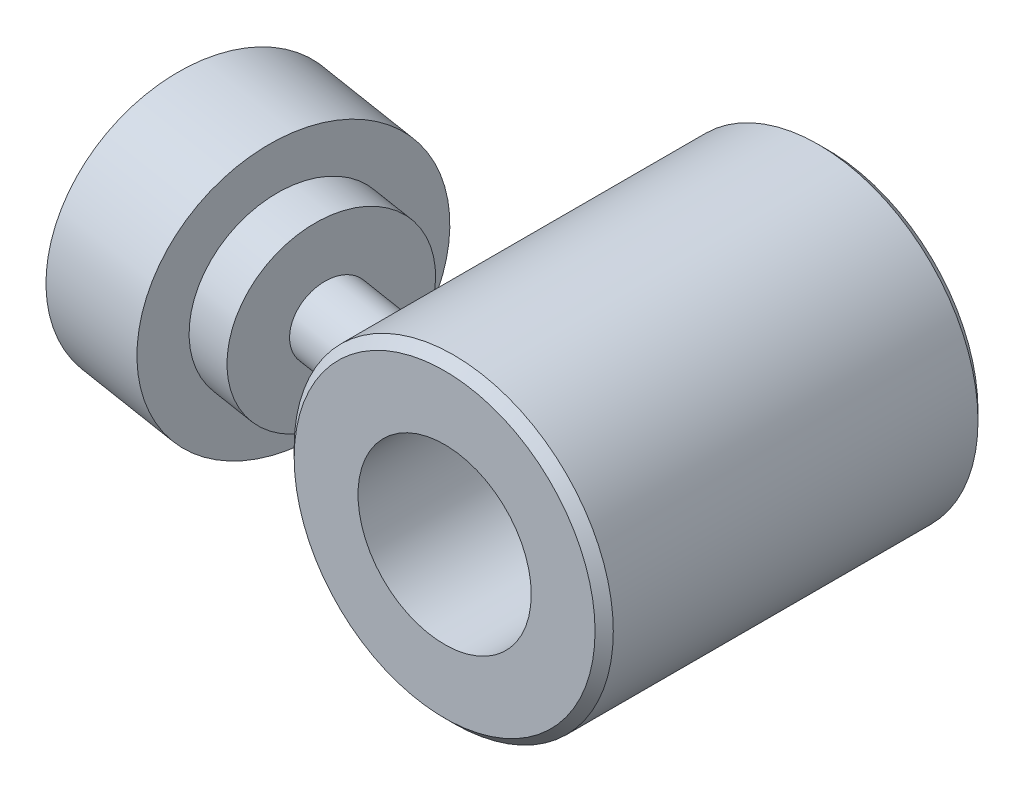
ISO-10303-21;
HEADER;
FILE_DESCRIPTION(('STEP AP214'),'2;1');
FILE_NAME('part.step','',(''),(''),'','','');
FILE_SCHEMA(('AUTOMOTIVE_DESIGN { 1 0 10303 214 1 1 1 1 }'));
ENDSEC;
DATA;
#1=APPLICATION_CONTEXT('core data for automotive mechanical design processes');
#2=APPLICATION_PROTOCOL_DEFINITION('international standard','automotive_design',2000,#1);
#3=PRODUCT_CONTEXT('',#1,'mechanical');
#4=PRODUCT('Part','Part','',(#3));
#5=PRODUCT_RELATED_PRODUCT_CATEGORY('part','',(#4));
#6=PRODUCT_DEFINITION_FORMATION('','',#4);
#7=PRODUCT_DEFINITION_CONTEXT('part definition',#1,'design');
#8=PRODUCT_DEFINITION('design','',#6,#7);
#9=PRODUCT_DEFINITION_SHAPE('','',#8);
#10=(LENGTH_UNIT() NAMED_UNIT(*) SI_UNIT(.MILLI.,.METRE.));
#11=(NAMED_UNIT(*) PLANE_ANGLE_UNIT() SI_UNIT($,.RADIAN.));
#12=(NAMED_UNIT(*) SI_UNIT($,.STERADIAN.) SOLID_ANGLE_UNIT());
#13=UNCERTAINTY_MEASURE_WITH_UNIT(LENGTH_MEASURE(1.E-05),#10,'distance_accuracy_value','');
#14=(GEOMETRIC_REPRESENTATION_CONTEXT(3) GLOBAL_UNCERTAINTY_ASSIGNED_CONTEXT((#13)) GLOBAL_UNIT_ASSIGNED_CONTEXT((#10,
#11,#12)) REPRESENTATION_CONTEXT('',''));
#15=CARTESIAN_POINT('',(0.,0.,0.));
#16=DIRECTION('',(0.,0.,1.));
#17=DIRECTION('',(1.,0.,0.));
#18=AXIS2_PLACEMENT_3D('',#15,#16,#17);
#19=CARTESIAN_POINT('',(-37.1481458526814,0.,25.3880394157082));
#20=DIRECTION('',(0.987688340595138,0.,0.156434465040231));
#21=DIRECTION('',(-0.156434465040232,0.,0.987688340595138));
#22=AXIS2_PLACEMENT_3D('',#19,#20,#21);
#23=CYLINDRICAL_SURFACE('',#22,4.);
#24=CARTESIAN_POINT('',(-17.5,0.,32.549860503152));
#25=CARTESIAN_POINT('',(-17.4999957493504,0.224614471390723,32.5498539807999));
#26=CARTESIAN_POINT('',(-17.4956327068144,0.449318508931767,32.5313396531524));
#27=CARTESIAN_POINT('',(-17.4786392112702,0.892435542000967,32.4577221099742));
#28=CARTESIAN_POINT('',(-17.466003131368,1.11084415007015,32.4025939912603));
#29=CARTESIAN_POINT('',(-17.4338463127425,1.53500330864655,32.2571782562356));
#30=CARTESIAN_POINT('',(-17.4143281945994,1.74075864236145,32.1669040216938));
#31=CARTESIAN_POINT('',(-17.3705421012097,2.13387663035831,31.9534994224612));
#32=CARTESIAN_POINT('',(-17.3462746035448,2.32124113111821,31.8303723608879));
#33=CARTESIAN_POINT('',(-17.2956371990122,2.67254969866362,31.554214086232));
#34=CARTESIAN_POINT('',(-17.2692645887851,2.83646287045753,31.4011440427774));
#35=CARTESIAN_POINT('',(-17.2174178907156,3.13586762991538,31.0692182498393));
#36=CARTESIAN_POINT('',(-17.1919437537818,3.27136077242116,30.890363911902));
#37=CARTESIAN_POINT('',(-17.1450047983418,3.50904954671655,30.5132847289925));
#38=CARTESIAN_POINT('',(-17.1235096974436,3.61150148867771,30.3152252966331));
#39=CARTESIAN_POINT('',(-17.0867315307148,3.78169775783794,29.9041969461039));
#40=CARTESIAN_POINT('',(-17.071447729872,3.84944619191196,29.6912297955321));
#41=CARTESIAN_POINT('',(-17.0489280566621,3.94798646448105,29.2592561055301));
#42=CARTESIAN_POINT('',(-17.0415966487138,3.9792173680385,29.0403543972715));
#43=CARTESIAN_POINT('',(-17.0353528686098,4.00586319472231,28.6002825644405));
#44=CARTESIAN_POINT('',(-17.0364409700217,4.0012761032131,28.3791123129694));
#45=CARTESIAN_POINT('',(-17.0468237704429,3.95680559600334,27.9380003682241));
#46=CARTESIAN_POINT('',(-17.0562129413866,3.91651584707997,27.7181022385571));
#47=CARTESIAN_POINT('',(-17.0821528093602,3.80177307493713,27.287851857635));
#48=CARTESIAN_POINT('',(-17.0987051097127,3.72731240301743,27.0775017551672));
#49=CARTESIAN_POINT('',(-17.1378795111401,3.54292035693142,26.6635686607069));
#50=CARTESIAN_POINT('',(-17.1607139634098,3.43171388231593,26.460573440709));
#51=CARTESIAN_POINT('',(-17.2095501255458,3.17774497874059,26.0757614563));
#52=CARTESIAN_POINT('',(-17.2355525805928,3.03497511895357,25.8939496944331));
#53=CARTESIAN_POINT('',(-17.2885137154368,2.71731655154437,25.5523458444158));
#54=CARTESIAN_POINT('',(-17.3154801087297,2.54171848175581,25.3932124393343));
#55=CARTESIAN_POINT('',(-17.3665728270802,2.16521302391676,25.1077562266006));
#56=CARTESIAN_POINT('',(-17.3906996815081,1.96431036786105,24.9814272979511));
#57=CARTESIAN_POINT('',(-17.4324970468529,1.54923721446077,24.7698430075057));
#58=CARTESIAN_POINT('',(-17.4503460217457,1.33567891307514,24.6834256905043));
#59=CARTESIAN_POINT('',(-17.4784212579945,0.896184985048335,24.5497264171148));
#60=CARTESIAN_POINT('',(-17.4886512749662,0.670255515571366,24.5024251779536));
#61=CARTESIAN_POINT('',(-17.4998301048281,0.227725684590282,24.4508532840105));
#62=CARTESIAN_POINT('',(-17.5013210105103,0.0114294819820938,24.4440688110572));
#63=CARTESIAN_POINT('',(-17.4963048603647,-0.419085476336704,24.4671089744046));
#64=CARTESIAN_POINT('',(-17.489799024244,-0.63330454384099,24.4969280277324));
#65=CARTESIAN_POINT('',(-17.4697946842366,-1.04801423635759,24.5906483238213));
#66=CARTESIAN_POINT('',(-17.4564779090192,-1.24871532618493,24.6536650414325));
#67=CARTESIAN_POINT('',(-17.4243532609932,-1.63704573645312,24.8108094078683));
#68=CARTESIAN_POINT('',(-17.4055445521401,-1.8246730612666,24.9049417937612));
#69=CARTESIAN_POINT('',(-17.3635294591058,-2.18924524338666,25.1252195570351));
#70=CARTESIAN_POINT('',(-17.3401852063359,-2.3655305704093,25.2524280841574));
#71=CARTESIAN_POINT('',(-17.2919524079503,-2.69560016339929,25.5330478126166));
#72=CARTESIAN_POINT('',(-17.2670633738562,-2.84937725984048,25.6864673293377));
#73=CARTESIAN_POINT('',(-17.2166804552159,-3.13990421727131,26.0255416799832));
#74=CARTESIAN_POINT('',(-17.1912429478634,-3.27503349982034,26.2125956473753));
#75=CARTESIAN_POINT('',(-17.144170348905,-3.51314694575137,26.6066225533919));
#76=CARTESIAN_POINT('',(-17.1225360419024,-3.61612447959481,26.8135995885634));
#77=CARTESIAN_POINT('',(-17.0850498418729,-3.78935161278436,27.2478052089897));
#78=CARTESIAN_POINT('',(-17.0693664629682,-3.85866112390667,27.4754252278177));
#79=CARTESIAN_POINT('',(-17.046655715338,-3.95779784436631,27.9395346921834));
#80=CARTESIAN_POINT('',(-17.0396266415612,-3.98763283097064,28.176022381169));
#81=CARTESIAN_POINT('',(-17.0353470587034,-4.00587500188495,28.6441743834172));
#82=CARTESIAN_POINT('',(-17.0378324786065,-3.9954009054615,28.875792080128));
#83=CARTESIAN_POINT('',(-17.0518556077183,-3.93512027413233,29.3335629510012));
#84=CARTESIAN_POINT('',(-17.0633912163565,-3.88532286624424,29.5597173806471));
#85=CARTESIAN_POINT('',(-17.0936083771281,-3.75008091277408,29.9911728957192));
#86=CARTESIAN_POINT('',(-17.1120042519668,-3.66605044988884,30.1969386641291));
#87=CARTESIAN_POINT('',(-17.1538823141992,-3.46479928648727,30.5909656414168));
#88=CARTESIAN_POINT('',(-17.1773642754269,-3.34758006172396,30.7792276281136));
#89=CARTESIAN_POINT('',(-17.2266034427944,-3.08413874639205,31.1318911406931));
#90=CARTESIAN_POINT('',(-17.2523445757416,-2.93811357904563,31.2964422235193));
#91=CARTESIAN_POINT('',(-17.3034160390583,-2.62061004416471,31.598945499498));
#92=CARTESIAN_POINT('',(-17.3287462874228,-2.44912666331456,31.7368924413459));
#93=CARTESIAN_POINT('',(-17.3765824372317,-2.08299901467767,31.9843622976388));
#94=CARTESIAN_POINT('',(-17.3990460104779,-1.88807553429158,32.0934801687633));
#95=CARTESIAN_POINT('',(-17.4382827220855,-1.48246254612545,32.2780292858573));
#96=CARTESIAN_POINT('',(-17.4550595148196,-1.27178326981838,32.3534821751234));
#97=CARTESIAN_POINT('',(-17.4784899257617,-0.884370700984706,32.4571671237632));
#98=CARTESIAN_POINT('',(-17.4865066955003,-0.709420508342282,32.491873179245));
#99=CARTESIAN_POINT('',(-17.4972634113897,-0.356332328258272,32.5382224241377));
#100=CARTESIAN_POINT('',(-17.5000033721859,-0.178194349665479,32.5498656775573));
#101=CARTESIAN_POINT('',(-17.5,0.,32.549860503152));
#102=B_SPLINE_CURVE_WITH_KNOTS('',3,(#24,#25,#26,#27,#28,#29,#30,#31,#32,#33,#34,#35,#36,#37,
#38,#39,#40,#41,#42,#43,#44,#45,#46,#47,#48,#49,#50,#51,#52,#53,#54,#55,#56,#57,#58,#59,#60,#61,
#62,#63,#64,#65,#66,#67,#68,#69,#70,#71,#72,#73,#74,#75,#76,#77,#78,#79,#80,#81,#82,#83,#84,#85,
#86,#87,#88,#89,#90,#91,#92,#93,#94,#95,#96,#97,#98,#99,#100,#101),.UNSPECIFIED.,.T.,.F.,(4,2,2,
2,2,2,2,2,2,2,2,2,2,2,2,2,2,2,2,2,2,2,2,2,2,2,2,2,2,2,2,2,2,2,2,2,2,2,4),(0.,0.673201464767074,
1.34686128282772,2.02026485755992,2.6936007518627,3.36781569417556,4.04199374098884,
4.71080864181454,5.37954437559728,6.0401541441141,6.70080106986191,7.36906481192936,
8.03747820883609,8.73207239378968,9.42683027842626,10.1388354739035,10.8507077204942,
11.5402958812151,12.2295438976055,12.8755434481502,13.5214444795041,14.150946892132,
14.7805451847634,15.433628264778,16.0869189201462,16.7802373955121,17.4736987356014,
18.1855455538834,18.8972521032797,19.5893506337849,20.2812885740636,20.9471508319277,
21.61298348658,22.2744129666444,22.9359728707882,23.6063851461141,24.2763657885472,
24.8104410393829,25.3445148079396),.UNSPECIFIED.);
#103=CARTESIAN_POINT('',(-17.5,0.,32.549860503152));
#104=VERTEX_POINT('',#103);
#105=EDGE_CURVE('E216',#104,#104,#102,.T.);
#106=ORIENTED_EDGE('',*,*,#105,.T.);
#107=EDGE_LOOP('',(#106));
#108=FACE_BOUND('',#107,.T.);
#109=CARTESIAN_POINT('',(-27.5181845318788,0.,26.9132754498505));
#110=DIRECTION('',(-0.987688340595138,0.,-0.156434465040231));
#111=DIRECTION('',(0.,1.,0.));
#112=AXIS2_PLACEMENT_3D('',#109,#110,#111);
#113=CIRCLE('',#112,4.);
#114=CARTESIAN_POINT('',(-27.5181845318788,4.00000000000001,26.9132754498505));
#115=VERTEX_POINT('',#114);
#116=EDGE_CURVE('E212',#115,#115,#113,.T.);
#117=ORIENTED_EDGE('',*,*,#116,.F.);
#118=EDGE_LOOP('',(#117));
#119=FACE_BOUND('',#118,.T.);
#120=ADVANCED_FACE('F15',(#108,#119),#23,.T.);
#121=CARTESIAN_POINT('',(-35.5515849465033,0.,29.6907703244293));
#122=DIRECTION('',(-0.987688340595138,0.,-0.156434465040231));
#123=DIRECTION('',(0.156434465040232,0.,-0.987688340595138));
#124=AXIS2_PLACEMENT_3D('',#121,#122,#123);
#125=PLANE('',#124);
#126=DIRECTION('',(0.135476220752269,0.5,-0.855363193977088));
#127=VECTOR('',#126,1.);
#128=CARTESIAN_POINT('',(-35.2387160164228,1.15470053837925,27.7153936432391));
#129=LINE('',#128,#127);
#130=CARTESIAN_POINT('',(-35.2387160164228,1.15470053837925,27.7153936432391));
#131=VERTEX_POINT('',#130);
#132=CARTESIAN_POINT('',(-34.9258470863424,2.3094010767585,25.7400169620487));
#133=VERTEX_POINT('',#132);
#134=EDGE_CURVE('E364',#131,#133,#129,.T.);
#135=ORIENTED_EDGE('',*,*,#134,.T.);
#136=DIRECTION('',(-0.135476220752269,0.5,0.855363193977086));
#137=VECTOR('',#136,1.);
#138=CARTESIAN_POINT('',(-34.6129781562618,1.15470053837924,23.7646402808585));
#139=LINE('',#138,#137);
#140=CARTESIAN_POINT('',(-34.6129781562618,1.15470053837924,23.7646402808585));
#141=VERTEX_POINT('',#140);
#142=EDGE_CURVE('E367',#141,#133,#139,.T.);
#143=ORIENTED_EDGE('',*,*,#142,.F.);
#144=DIRECTION('',(0.,1.,0.));
#145=VECTOR('',#144,1.);
#146=CARTESIAN_POINT('',(-34.6129781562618,-1.15470053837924,23.7646402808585));
#147=LINE('',#146,#145);
#148=CARTESIAN_POINT('',(-34.6129781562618,-1.15470053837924,23.7646402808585));
#149=VERTEX_POINT('',#148);
#150=EDGE_CURVE('E381',#149,#141,#147,.T.);
#151=ORIENTED_EDGE('',*,*,#150,.F.);
#152=DIRECTION('',(-0.135476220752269,-0.5,0.855363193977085));
#153=VECTOR('',#152,1.);
#154=CARTESIAN_POINT('',(-34.6129781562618,-1.15470053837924,23.7646402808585));
#155=LINE('',#154,#153);
#156=CARTESIAN_POINT('',(-34.9258470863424,-2.30940107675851,25.7400169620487));
#157=VERTEX_POINT('',#156);
#158=EDGE_CURVE('E386',#149,#157,#155,.T.);
#159=ORIENTED_EDGE('',*,*,#158,.T.);
#160=DIRECTION('',(0.135476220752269,-0.5,-0.855363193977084));
#161=VECTOR('',#160,1.);
#162=CARTESIAN_POINT('',(-35.2387160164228,-1.15470053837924,27.7153936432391));
#163=LINE('',#162,#161);
#164=CARTESIAN_POINT('',(-35.2387160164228,-1.15470053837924,27.7153936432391));
#165=VERTEX_POINT('',#164);
#166=EDGE_CURVE('E410',#165,#157,#163,.T.);
#167=ORIENTED_EDGE('',*,*,#166,.F.);
#168=DIRECTION('',(0.,1.,0.));
#169=VECTOR('',#168,1.);
#170=CARTESIAN_POINT('',(-35.2387160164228,-1.15470053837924,27.7153936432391));
#171=LINE('',#170,#169);
#172=EDGE_CURVE('E370',#165,#131,#171,.T.);
#173=ORIENTED_EDGE('',*,*,#172,.T.);
#174=EDGE_LOOP('',(#135,#143,#151,#159,#167,#173));
#175=FACE_BOUND('',#174,.T.);
#176=ADVANCED_FACE('F17',(#175),#125,.T.);
#177=CARTESIAN_POINT('',(-34.6129781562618,-1.15470053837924,23.7646402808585));
#178=DIRECTION('',(-0.156434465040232,0.,0.987688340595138));
#179=DIRECTION('',(-0.987688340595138,0.,-0.156434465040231));
#180=AXIS2_PLACEMENT_3D('',#177,#178,#179);
#181=PLANE('',#180);
#182=DIRECTION('',(-0.987688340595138,0.,-0.156434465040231));
#183=VECTOR('',#182,1.);
#184=CARTESIAN_POINT('',(-34.6129781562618,1.15470053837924,23.7646402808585));
#185=LINE('',#184,#183);
#186=CARTESIAN_POINT('',(-37.0821990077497,1.15470053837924,23.3735541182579));
#187=VERTEX_POINT('',#186);
#188=EDGE_CURVE('E379',#141,#187,#185,.T.);
#189=ORIENTED_EDGE('',*,*,#188,.T.);
#190=DIRECTION('',(0.,1.,0.));
#191=VECTOR('',#190,1.);
#192=CARTESIAN_POINT('',(-37.0821990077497,-1.15470053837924,23.3735541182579));
#193=LINE('',#192,#191);
#194=CARTESIAN_POINT('',(-37.0821990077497,-1.15470053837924,23.3735541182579));
#195=VERTEX_POINT('',#194);
#196=EDGE_CURVE('E398',#195,#187,#193,.T.);
#197=ORIENTED_EDGE('',*,*,#196,.F.);
#198=DIRECTION('',(-0.987688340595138,0.,-0.156434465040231));
#199=VECTOR('',#198,1.);
#200=CARTESIAN_POINT('',(-34.6129781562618,-1.15470053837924,23.7646402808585));
#201=LINE('',#200,#199);
#202=EDGE_CURVE('E421',#149,#195,#201,.T.);
#203=ORIENTED_EDGE('',*,*,#202,.F.);
#204=ORIENTED_EDGE('',*,*,#150,.T.);
#205=EDGE_LOOP('',(#189,#197,#203,#204));
#206=FACE_BOUND('',#205,.T.);
#207=ADVANCED_FACE('F349',(#206),#181,.T.);
#208=CARTESIAN_POINT('',(-34.6129781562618,-1.15470053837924,23.7646402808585));
#209=DIRECTION('',(0.0782172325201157,-0.866025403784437,-0.493844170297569));
#210=DIRECTION('',(0.135476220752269,0.5,-0.855363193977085));
#211=AXIS2_PLACEMENT_3D('',#208,#209,#210);
#212=PLANE('',#211);
#213=ORIENTED_EDGE('',*,*,#202,.T.);
#214=DIRECTION('',(-0.135476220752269,-0.5,0.855363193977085));
#215=VECTOR('',#214,1.);
#216=CARTESIAN_POINT('',(-37.0821990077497,-1.15470053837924,23.3735541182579));
#217=LINE('',#216,#215);
#218=CARTESIAN_POINT('',(-37.3950679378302,-2.30940107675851,25.3489307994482));
#219=VERTEX_POINT('',#218);
#220=EDGE_CURVE('E394',#195,#219,#217,.T.);
#221=ORIENTED_EDGE('',*,*,#220,.T.);
#222=DIRECTION('',(-0.987688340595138,0.,-0.156434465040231));
#223=VECTOR('',#222,1.);
#224=CARTESIAN_POINT('',(-34.9258470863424,-2.30940107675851,25.7400169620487));
#225=LINE('',#224,#223);
#226=EDGE_CURVE('E424',#157,#219,#225,.T.);
#227=ORIENTED_EDGE('',*,*,#226,.F.);
#228=ORIENTED_EDGE('',*,*,#158,.F.);
#229=EDGE_LOOP('',(#213,#221,#227,#228));
#230=FACE_BOUND('',#229,.T.);
#231=ADVANCED_FACE('F356',(#230),#212,.F.);
#232=CARTESIAN_POINT('',(-35.2387160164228,-1.15470053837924,27.7153936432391));
#233=DIRECTION('',(0.0782172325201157,0.866025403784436,-0.493844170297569));
#234=DIRECTION('',(-0.135476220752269,0.5,0.855363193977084));
#235=AXIS2_PLACEMENT_3D('',#232,#233,#234);
#236=PLANE('',#235);
#237=ORIENTED_EDGE('',*,*,#226,.T.);
#238=DIRECTION('',(0.135476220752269,-0.5,-0.855363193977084));
#239=VECTOR('',#238,1.);
#240=CARTESIAN_POINT('',(-37.7079368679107,-1.15470053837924,27.3243074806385));
#241=LINE('',#240,#239);
#242=CARTESIAN_POINT('',(-37.7079368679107,-1.15470053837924,27.3243074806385));
#243=VERTEX_POINT('',#242);
#244=EDGE_CURVE('E390',#243,#219,#241,.T.);
#245=ORIENTED_EDGE('',*,*,#244,.F.);
#246=DIRECTION('',(-0.987688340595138,0.,-0.156434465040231));
#247=VECTOR('',#246,1.);
#248=CARTESIAN_POINT('',(-35.2387160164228,-1.15470053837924,27.7153936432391));
#249=LINE('',#248,#247);
#250=EDGE_CURVE('E95',#165,#243,#249,.T.);
#251=ORIENTED_EDGE('',*,*,#250,.F.);
#252=ORIENTED_EDGE('',*,*,#166,.T.);
#253=EDGE_LOOP('',(#237,#245,#251,#252));
#254=FACE_BOUND('',#253,.T.);
#255=ADVANCED_FACE('F452',(#254),#236,.T.);
#256=CARTESIAN_POINT('',(-35.2387160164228,-1.15470053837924,27.7153936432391));
#257=DIRECTION('',(-0.156434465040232,0.,0.987688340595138));
#258=DIRECTION('',(-0.987688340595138,0.,-0.156434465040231));
#259=AXIS2_PLACEMENT_3D('',#256,#257,#258);
#260=PLANE('',#259);
#261=ORIENTED_EDGE('',*,*,#250,.T.);
#262=DIRECTION('',(0.,1.,0.));
#263=VECTOR('',#262,1.);
#264=CARTESIAN_POINT('',(-37.7079368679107,-1.15470053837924,27.3243074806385));
#265=LINE('',#264,#263);
#266=CARTESIAN_POINT('',(-37.7079368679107,1.15470053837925,27.3243074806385));
#267=VERTEX_POINT('',#266);
#268=EDGE_CURVE('E187',#243,#267,#265,.T.);
#269=ORIENTED_EDGE('',*,*,#268,.T.);
#270=DIRECTION('',(-0.987688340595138,0.,-0.156434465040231));
#271=VECTOR('',#270,1.);
#272=CARTESIAN_POINT('',(-35.2387160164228,1.15470053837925,27.7153936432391));
#273=LINE('',#272,#271);
#274=EDGE_CURVE('E100',#131,#267,#273,.T.);
#275=ORIENTED_EDGE('',*,*,#274,.F.);
#276=ORIENTED_EDGE('',*,*,#172,.F.);
#277=EDGE_LOOP('',(#261,#269,#275,#276));
#278=FACE_BOUND('',#277,.T.);
#279=ADVANCED_FACE('F448',(#278),#260,.F.);
#280=CARTESIAN_POINT('',(-35.2387160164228,1.15470053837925,27.7153936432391));
#281=DIRECTION('',(-0.0782172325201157,0.86602540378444,0.493844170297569));
#282=DIRECTION('',(-0.135476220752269,-0.5,0.855363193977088));
#283=AXIS2_PLACEMENT_3D('',#280,#281,#282);
#284=PLANE('',#283);
#285=ORIENTED_EDGE('',*,*,#274,.T.);
#286=DIRECTION('',(0.135476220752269,0.5,-0.855363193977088));
#287=VECTOR('',#286,1.);
#288=CARTESIAN_POINT('',(-37.7079368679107,1.15470053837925,27.3243074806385));
#289=LINE('',#288,#287);
#290=CARTESIAN_POINT('',(-37.3950679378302,2.3094010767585,25.3489307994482));
#291=VERTEX_POINT('',#290);
#292=EDGE_CURVE('E19',#267,#291,#289,.T.);
#293=ORIENTED_EDGE('',*,*,#292,.T.);
#294=DIRECTION('',(-0.987688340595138,0.,-0.156434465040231));
#295=VECTOR('',#294,1.);
#296=CARTESIAN_POINT('',(-34.9258470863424,2.3094010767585,25.7400169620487));
#297=LINE('',#296,#295);
#298=EDGE_CURVE('E372',#133,#291,#297,.T.);
#299=ORIENTED_EDGE('',*,*,#298,.F.);
#300=ORIENTED_EDGE('',*,*,#134,.F.);
#301=EDGE_LOOP('',(#285,#293,#299,#300));
#302=FACE_BOUND('',#301,.T.);
#303=ADVANCED_FACE('F451',(#302),#284,.F.);
#304=CARTESIAN_POINT('',(-34.6129781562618,1.15470053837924,23.7646402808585));
#305=DIRECTION('',(-0.0782172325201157,-0.866025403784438,0.493844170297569));
#306=DIRECTION('',(0.135476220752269,-0.5,-0.855363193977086));
#307=AXIS2_PLACEMENT_3D('',#304,#305,#306);
#308=PLANE('',#307);
#309=ORIENTED_EDGE('',*,*,#142,.T.);
#310=ORIENTED_EDGE('',*,*,#298,.T.);
#311=DIRECTION('',(-0.135476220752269,0.5,0.855363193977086));
#312=VECTOR('',#311,1.);
#313=CARTESIAN_POINT('',(-37.0821990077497,1.15470053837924,23.3735541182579));
#314=LINE('',#313,#312);
#315=EDGE_CURVE('E403',#187,#291,#314,.T.);
#316=ORIENTED_EDGE('',*,*,#315,.F.);
#317=ORIENTED_EDGE('',*,*,#188,.F.);
#318=EDGE_LOOP('',(#309,#310,#316,#317));
#319=FACE_BOUND('',#318,.T.);
#320=ADVANCED_FACE('F376',(#319),#308,.T.);
#321=CARTESIAN_POINT('',(-37.3950679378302,0.,25.3489307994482));
#322=DIRECTION('',(0.987688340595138,0.,0.156434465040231));
#323=DIRECTION('',(-0.156434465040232,0.,0.987688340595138));
#324=AXIS2_PLACEMENT_3D('',#321,#322,#323);
#325=PLANE('',#324);
#326=ORIENTED_EDGE('',*,*,#315,.T.);
#327=ORIENTED_EDGE('',*,*,#292,.F.);
#328=ORIENTED_EDGE('',*,*,#268,.F.);
#329=ORIENTED_EDGE('',*,*,#244,.T.);
#330=ORIENTED_EDGE('',*,*,#220,.F.);
#331=ORIENTED_EDGE('',*,*,#196,.T.);
#332=EDGE_LOOP('',(#326,#327,#328,#329,#330,#331));
#333=FACE_BOUND('',#332,.T.);
#334=CARTESIAN_POINT('',(-37.3950679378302,0.,25.3489307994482));
#335=DIRECTION('',(0.987688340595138,0.,0.156434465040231));
#336=DIRECTION('',(-0.156434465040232,0.,0.987688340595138));
#337=AXIS2_PLACEMENT_3D('',#334,#335,#336);
#338=CIRCLE('',#337,3.5);
#339=CARTESIAN_POINT('',(-37.942588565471,0.,28.8058399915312));
#340=VERTEX_POINT('',#339);
#341=EDGE_CURVE('E428',#340,#340,#338,.T.);
#342=ORIENTED_EDGE('',*,*,#341,.F.);
#343=EDGE_LOOP('',(#342));
#344=FACE_BOUND('',#343,.T.);
#345=ADVANCED_FACE('F438',(#333,#344),#325,.F.);
#346=CARTESIAN_POINT('',(-36.9012237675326,0.,25.4271480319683));
#347=DIRECTION('',(0.987688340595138,0.,0.156434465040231));
#348=DIRECTION('',(-0.156434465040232,0.,0.987688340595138));
#349=AXIS2_PLACEMENT_3D('',#346,#347,#348);
#350=CONICAL_SURFACE('',#349,4.,0.785398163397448);
#351=ORIENTED_EDGE('',*,*,#341,.T.);
#352=EDGE_LOOP('',(#351));
#353=FACE_BOUND('',#352,.T.);
#354=CARTESIAN_POINT('',(-36.9012237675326,0.,25.4271480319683));
#355=DIRECTION('',(0.987688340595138,0.,0.156434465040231));
#356=DIRECTION('',(-0.156434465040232,0.,0.987688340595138));
#357=AXIS2_PLACEMENT_3D('',#354,#355,#356);
#358=CIRCLE('',#357,4.);
#359=CARTESIAN_POINT('',(-37.5269616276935,0.,29.3779013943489));
#360=VERTEX_POINT('',#359);
#361=EDGE_CURVE('E225',#360,#360,#358,.T.);
#362=ORIENTED_EDGE('',*,*,#361,.F.);
#363=EDGE_LOOP('',(#362));
#364=FACE_BOUND('',#363,.T.);
#365=ADVANCED_FACE('F360',(#353,#364),#350,.T.);
#366=CARTESIAN_POINT('',(0.,-15.,28.1547005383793));
#367=DIRECTION('',(0.,-1.,0.));
#368=DIRECTION('',(1.,0.,0.));
#369=AXIS2_PLACEMENT_3D('',#366,#367,#368);
#370=PLANE('',#369);
#371=DIRECTION('',(-0.866025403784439,0.,0.5));
#372=VECTOR('',#371,1.);
#373=CARTESIAN_POINT('',(1.,-15.,27.5773502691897));
#374=LINE('',#373,#372);
#375=CARTESIAN_POINT('',(1.,-15.,27.5773502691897));
#376=VERTEX_POINT('',#375);
#377=CARTESIAN_POINT('',(0.,-15.,28.1547005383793));
#378=VERTEX_POINT('',#377);
#379=EDGE_CURVE('E149',#376,#378,#374,.T.);
#380=ORIENTED_EDGE('',*,*,#379,.T.);
#381=DIRECTION('',(-0.866025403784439,0.,-0.5));
#382=VECTOR('',#381,1.);
#383=CARTESIAN_POINT('',(0.,-15.,28.1547005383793));
#384=LINE('',#383,#382);
#385=CARTESIAN_POINT('',(-1.,-15.,27.5773502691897));
#386=VERTEX_POINT('',#385);
#387=EDGE_CURVE('E175',#378,#386,#384,.T.);
#388=ORIENTED_EDGE('',*,*,#387,.T.);
#389=DIRECTION('',(0.,0.,-1.));
#390=VECTOR('',#389,1.);
#391=CARTESIAN_POINT('',(-1.,-15.,27.5773502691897));
#392=LINE('',#391,#390);
#393=CARTESIAN_POINT('',(-1.,-15.,26.4226497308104));
#394=VERTEX_POINT('',#393);
#395=EDGE_CURVE('E171',#386,#394,#392,.T.);
#396=ORIENTED_EDGE('',*,*,#395,.T.);
#397=DIRECTION('',(0.866025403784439,0.,-0.5));
#398=VECTOR('',#397,1.);
#399=CARTESIAN_POINT('',(-1.,-15.,26.4226497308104));
#400=LINE('',#399,#398);
#401=CARTESIAN_POINT('',(0.,-15.,25.8452994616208));
#402=VERTEX_POINT('',#401);
#403=EDGE_CURVE('E168',#394,#402,#400,.T.);
#404=ORIENTED_EDGE('',*,*,#403,.T.);
#405=DIRECTION('',(0.866025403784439,0.,0.5));
#406=VECTOR('',#405,1.);
#407=CARTESIAN_POINT('',(0.,-15.,25.8452994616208));
#408=LINE('',#407,#406);
#409=CARTESIAN_POINT('',(1.,-15.,26.4226497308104));
#410=VERTEX_POINT('',#409);
#411=EDGE_CURVE('E123',#402,#410,#408,.T.);
#412=ORIENTED_EDGE('',*,*,#411,.T.);
#413=DIRECTION('',(0.,0.,1.));
#414=VECTOR('',#413,1.);
#415=CARTESIAN_POINT('',(1.,-15.,26.4226497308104));
#416=LINE('',#415,#414);
#417=EDGE_CURVE('E161',#410,#376,#416,.T.);
#418=ORIENTED_EDGE('',*,*,#417,.T.);
#419=EDGE_LOOP('',(#380,#388,#396,#404,#412,#418));
#420=FACE_BOUND('',#419,.T.);
#421=ADVANCED_FACE('F320',(#420),#370,.T.);
#422=CARTESIAN_POINT('',(0.,-15.,28.1547005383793));
#423=DIRECTION('',(-0.5,0.,0.866025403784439));
#424=DIRECTION('',(-0.866025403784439,0.,-0.5));
#425=AXIS2_PLACEMENT_3D('',#422,#423,#424);
#426=PLANE('',#425);
#427=DIRECTION('',(-0.866025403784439,0.,-0.5));
#428=VECTOR('',#427,1.);
#429=CARTESIAN_POINT('',(0.,-16.5,28.1547005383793));
#430=LINE('',#429,#428);
#431=CARTESIAN_POINT('',(0.,-16.5,28.1547005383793));
#432=VERTEX_POINT('',#431);
#433=CARTESIAN_POINT('',(-1.,-16.5,27.5773502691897));
#434=VERTEX_POINT('',#433);
#435=EDGE_CURVE('E155',#432,#434,#430,.T.);
#436=ORIENTED_EDGE('',*,*,#435,.T.);
#437=DIRECTION('',(0.,-1.,0.));
#438=VECTOR('',#437,1.);
#439=CARTESIAN_POINT('',(-1.,-15.,27.5773502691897));
#440=LINE('',#439,#438);
#441=EDGE_CURVE('E35',#386,#434,#440,.T.);
#442=ORIENTED_EDGE('',*,*,#441,.F.);
#443=ORIENTED_EDGE('',*,*,#387,.F.);
#444=DIRECTION('',(0.,-1.,0.));
#445=VECTOR('',#444,1.);
#446=CARTESIAN_POINT('',(0.,-15.,28.1547005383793));
#447=LINE('',#446,#445);
#448=EDGE_CURVE('E165',#378,#432,#447,.T.);
#449=ORIENTED_EDGE('',*,*,#448,.T.);
#450=EDGE_LOOP('',(#436,#442,#443,#449));
#451=FACE_BOUND('',#450,.T.);
#452=ADVANCED_FACE('F444',(#451),#426,.F.);
#453=CARTESIAN_POINT('',(-1.,-15.,27.5773502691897));
#454=DIRECTION('',(-1.,0.,0.));
#455=DIRECTION('',(0.,0.,-1.));
#456=AXIS2_PLACEMENT_3D('',#453,#454,#455);
#457=PLANE('',#456);
#458=DIRECTION('',(0.,0.,-1.));
#459=VECTOR('',#458,1.);
#460=CARTESIAN_POINT('',(-1.,-16.5,27.5773502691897));
#461=LINE('',#460,#459);
#462=CARTESIAN_POINT('',(-1.,-16.5,26.4226497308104));
#463=VERTEX_POINT('',#462);
#464=EDGE_CURVE('E137',#434,#463,#461,.T.);
#465=ORIENTED_EDGE('',*,*,#464,.T.);
#466=DIRECTION('',(0.,-1.,0.));
#467=VECTOR('',#466,1.);
#468=CARTESIAN_POINT('',(-1.,-15.,26.4226497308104));
#469=LINE('',#468,#467);
#470=EDGE_CURVE('E128',#394,#463,#469,.T.);
#471=ORIENTED_EDGE('',*,*,#470,.F.);
#472=ORIENTED_EDGE('',*,*,#395,.F.);
#473=ORIENTED_EDGE('',*,*,#441,.T.);
#474=EDGE_LOOP('',(#465,#471,#472,#473));
#475=FACE_BOUND('',#474,.T.);
#476=ADVANCED_FACE('F529',(#475),#457,.F.);
#477=CARTESIAN_POINT('',(-1.,-15.,26.4226497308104));
#478=DIRECTION('',(-0.5,0.,-0.866025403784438));
#479=DIRECTION('',(0.866025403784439,0.,-0.5));
#480=AXIS2_PLACEMENT_3D('',#477,#478,#479);
#481=PLANE('',#480);
#482=DIRECTION('',(0.866025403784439,0.,-0.5));
#483=VECTOR('',#482,1.);
#484=CARTESIAN_POINT('',(-1.,-16.5,26.4226497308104));
#485=LINE('',#484,#483);
#486=CARTESIAN_POINT('',(0.,-16.5,25.8452994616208));
#487=VERTEX_POINT('',#486);
#488=EDGE_CURVE('E132',#463,#487,#485,.T.);
#489=ORIENTED_EDGE('',*,*,#488,.T.);
#490=DIRECTION('',(0.,-1.,0.));
#491=VECTOR('',#490,1.);
#492=CARTESIAN_POINT('',(0.,-15.,25.8452994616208));
#493=LINE('',#492,#491);
#494=EDGE_CURVE('E116',#402,#487,#493,.T.);
#495=ORIENTED_EDGE('',*,*,#494,.F.);
#496=ORIENTED_EDGE('',*,*,#403,.F.);
#497=ORIENTED_EDGE('',*,*,#470,.T.);
#498=EDGE_LOOP('',(#489,#495,#496,#497));
#499=FACE_BOUND('',#498,.T.);
#500=ADVANCED_FACE('F133',(#499),#481,.F.);
#501=CARTESIAN_POINT('',(0.,-15.,25.8452994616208));
#502=DIRECTION('',(0.5,0.,-0.866025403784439));
#503=DIRECTION('',(0.866025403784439,0.,0.5));
#504=AXIS2_PLACEMENT_3D('',#501,#502,#503);
#505=PLANE('',#504);
#506=DIRECTION('',(0.866025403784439,0.,0.5));
#507=VECTOR('',#506,1.);
#508=CARTESIAN_POINT('',(0.,-16.5,25.8452994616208));
#509=LINE('',#508,#507);
#510=CARTESIAN_POINT('',(1.,-16.5,26.4226497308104));
#511=VERTEX_POINT('',#510);
#512=EDGE_CURVE('E120',#487,#511,#509,.T.);
#513=ORIENTED_EDGE('',*,*,#512,.T.);
#514=DIRECTION('',(0.,-1.,0.));
#515=VECTOR('',#514,1.);
#516=CARTESIAN_POINT('',(1.,-15.,26.4226497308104));
#517=LINE('',#516,#515);
#518=EDGE_CURVE('E129',#410,#511,#517,.T.);
#519=ORIENTED_EDGE('',*,*,#518,.F.);
#520=ORIENTED_EDGE('',*,*,#411,.F.);
#521=ORIENTED_EDGE('',*,*,#494,.T.);
#522=EDGE_LOOP('',(#513,#519,#520,#521));
#523=FACE_BOUND('',#522,.T.);
#524=ADVANCED_FACE('F118',(#523),#505,.F.);
#525=CARTESIAN_POINT('',(1.,-15.,26.4226497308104));
#526=DIRECTION('',(1.,0.,0.));
#527=DIRECTION('',(0.,1.,0.));
#528=AXIS2_PLACEMENT_3D('',#525,#526,#527);
#529=PLANE('',#528);
#530=DIRECTION('',(0.,0.,1.));
#531=VECTOR('',#530,1.);
#532=CARTESIAN_POINT('',(1.,-16.5,26.4226497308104));
#533=LINE('',#532,#531);
#534=CARTESIAN_POINT('',(1.,-16.5,27.5773502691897));
#535=VERTEX_POINT('',#534);
#536=EDGE_CURVE('E142',#511,#535,#533,.T.);
#537=ORIENTED_EDGE('',*,*,#536,.T.);
#538=DIRECTION('',(0.,-1.,0.));
#539=VECTOR('',#538,1.);
#540=CARTESIAN_POINT('',(1.,-15.,27.5773502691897));
#541=LINE('',#540,#539);
#542=EDGE_CURVE('E729',#376,#535,#541,.T.);
#543=ORIENTED_EDGE('',*,*,#542,.F.);
#544=ORIENTED_EDGE('',*,*,#417,.F.);
#545=ORIENTED_EDGE('',*,*,#518,.T.);
#546=EDGE_LOOP('',(#537,#543,#544,#545));
#547=FACE_BOUND('',#546,.T.);
#548=ADVANCED_FACE('F550',(#547),#529,.F.);
#549=CARTESIAN_POINT('',(1.,-15.,27.5773502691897));
#550=DIRECTION('',(0.5,0.,0.866025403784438));
#551=DIRECTION('',(-0.866025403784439,0.,0.5));
#552=AXIS2_PLACEMENT_3D('',#549,#550,#551);
#553=PLANE('',#552);
#554=DIRECTION('',(-0.866025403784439,0.,0.5));
#555=VECTOR('',#554,1.);
#556=CARTESIAN_POINT('',(1.,-16.5,27.5773502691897));
#557=LINE('',#556,#555);
#558=EDGE_CURVE('E106',#535,#432,#557,.T.);
#559=ORIENTED_EDGE('',*,*,#558,.T.);
#560=ORIENTED_EDGE('',*,*,#448,.F.);
#561=ORIENTED_EDGE('',*,*,#379,.F.);
#562=ORIENTED_EDGE('',*,*,#542,.T.);
#563=EDGE_LOOP('',(#559,#560,#561,#562));
#564=FACE_BOUND('',#563,.T.);
#565=ADVANCED_FACE('F291',(#564),#553,.F.);
#566=CARTESIAN_POINT('',(0.,0.,0.));
#567=DIRECTION('',(0.,0.,1.));
#568=DIRECTION('',(1.,0.,0.));
#569=AXIS2_PLACEMENT_3D('',#566,#567,#568);
#570=CYLINDRICAL_SURFACE('',#569,4.5);
#571=CARTESIAN_POINT('',(0.,0.,0.));
#572=DIRECTION('',(0.,0.,1.));
#573=DIRECTION('',(1.,0.,0.));
#574=AXIS2_PLACEMENT_3D('',#571,#572,#573);
#575=CIRCLE('',#574,4.5);
#576=CARTESIAN_POINT('',(4.5,0.,0.));
#577=VERTEX_POINT('',#576);
#578=EDGE_CURVE('E281',#577,#577,#575,.T.);
#579=ORIENTED_EDGE('',*,*,#578,.F.);
#580=EDGE_LOOP('',(#579));
#581=FACE_BOUND('',#580,.T.);
#582=CARTESIAN_POINT('',(0.,0.,5.));
#583=DIRECTION('',(0.,0.,1.));
#584=DIRECTION('',(1.,0.,0.));
#585=AXIS2_PLACEMENT_3D('',#582,#583,#584);
#586=CIRCLE('',#585,4.5);
#587=CARTESIAN_POINT('',(4.5,0.,5.));
#588=VERTEX_POINT('',#587);
#589=EDGE_CURVE('E254',#588,#588,#586,.T.);
#590=ORIENTED_EDGE('',*,*,#589,.T.);
#591=EDGE_LOOP('',(#590));
#592=FACE_BOUND('',#591,.T.);
#593=ADVANCED_FACE('F289',(#581,#592),#570,.F.);
#594=CARTESIAN_POINT('',(0.,-16.5,27.));
#595=DIRECTION('',(0.,-1.,0.));
#596=DIRECTION('',(1.,0.,0.));
#597=AXIS2_PLACEMENT_3D('',#594,#595,#596);
#598=PLANE('',#597);
#599=ORIENTED_EDGE('',*,*,#558,.F.);
#600=ORIENTED_EDGE('',*,*,#536,.F.);
#601=ORIENTED_EDGE('',*,*,#512,.F.);
#602=ORIENTED_EDGE('',*,*,#488,.F.);
#603=ORIENTED_EDGE('',*,*,#464,.F.);
#604=ORIENTED_EDGE('',*,*,#435,.F.);
#605=EDGE_LOOP('',(#599,#600,#601,#602,#603,#604));
#606=FACE_BOUND('',#605,.T.);
#607=CARTESIAN_POINT('',(0.,-16.5,27.));
#608=DIRECTION('',(0.,-1.,0.));
#609=DIRECTION('',(1.,0.,0.));
#610=AXIS2_PLACEMENT_3D('',#607,#608,#609);
#611=CIRCLE('',#610,2.);
#612=CARTESIAN_POINT('',(2.,-16.5,27.));
#613=VERTEX_POINT('',#612);
#614=EDGE_CURVE('E211',#613,#613,#611,.T.);
#615=ORIENTED_EDGE('',*,*,#614,.T.);
#616=EDGE_LOOP('',(#615));
#617=FACE_BOUND('',#616,.T.);
#618=ADVANCED_FACE('F139',(#606,#617),#598,.T.);
#619=CARTESIAN_POINT('',(17.5,0.,0.));
#620=DIRECTION('',(0.,0.,-1.));
#621=DIRECTION('',(-1.,0.,0.));
#622=AXIS2_PLACEMENT_3D('',#619,#620,#621);
#623=PLANE('',#622);
#624=CARTESIAN_POINT('',(0.,0.,0.));
#625=DIRECTION('',(0.,0.,-1.));
#626=DIRECTION('',(-1.,0.,0.));
#627=AXIS2_PLACEMENT_3D('',#624,#625,#626);
#628=CIRCLE('',#627,16.5);
#629=CARTESIAN_POINT('',(-16.5,0.,0.));
#630=VERTEX_POINT('',#629);
#631=EDGE_CURVE('E160',#630,#630,#628,.T.);
#632=ORIENTED_EDGE('',*,*,#631,.T.);
#633=EDGE_LOOP('',(#632));
#634=FACE_BOUND('',#633,.T.);
#635=ORIENTED_EDGE('',*,*,#578,.T.);
#636=EDGE_LOOP('',(#635));
#637=FACE_BOUND('',#636,.T.);
#638=ADVANCED_FACE('F241',(#634,#637),#623,.T.);
#639=CARTESIAN_POINT('',(0.,-7.5,27.));
#640=DIRECTION('',(0.,-1.,0.));
#641=DIRECTION('',(0.,0.,-1.));
#642=AXIS2_PLACEMENT_3D('',#639,#640,#641);
#643=CYLINDRICAL_SURFACE('',#642,2.);
#644=CARTESIAN_POINT('',(0.,-17.5,25.));
#645=CARTESIAN_POINT('',(-0.111949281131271,-17.4999985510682,25.0000048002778));
#646=CARTESIAN_POINT('',(-0.223970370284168,-17.4989143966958,25.0094311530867));
#647=CARTESIAN_POINT('',(-0.444900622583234,-17.4946937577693,25.0468888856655));
#648=CARTESIAN_POINT('',(-0.553806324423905,-17.4915550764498,25.0749401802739));
#649=CARTESIAN_POINT('',(-0.765274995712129,-17.4835792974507,25.1488150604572));
#650=CARTESIAN_POINT('',(-0.867841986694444,-17.4787432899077,25.1946272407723));
#651=CARTESIAN_POINT('',(-1.06381060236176,-17.4679120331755,25.3026997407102));
#652=CARTESIAN_POINT('',(-1.15721390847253,-17.4619169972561,25.3649570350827));
#653=CARTESIAN_POINT('',(-1.33265783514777,-17.4494069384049,25.5044617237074));
#654=CARTESIAN_POINT('',(-1.41464987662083,-17.4428898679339,25.5817700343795));
#655=CARTESIAN_POINT('',(-1.5645257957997,-17.4300869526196,25.7490517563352));
#656=CARTESIAN_POINT('',(-1.63240898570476,-17.4238011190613,25.8390257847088));
#657=CARTESIAN_POINT('',(-1.75231750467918,-17.4121519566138,26.029395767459));
#658=CARTESIAN_POINT('',(-1.80429797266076,-17.4067912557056,26.129820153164));
#659=CARTESIAN_POINT('',(-1.89063905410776,-17.3976257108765,26.3380439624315));
#660=CARTESIAN_POINT('',(-1.9250002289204,-17.3938208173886,26.4458431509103));
#661=CARTESIAN_POINT('',(-1.97498120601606,-17.3882168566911,26.6652558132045));
#662=CARTESIAN_POINT('',(-1.99068245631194,-17.3864090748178,26.7768505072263));
#663=CARTESIAN_POINT('',(-2.00314979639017,-17.3849772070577,27.0011045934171));
#664=CARTESIAN_POINT('',(-1.99991652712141,-17.3853530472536,27.1137639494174));
#665=CARTESIAN_POINT('',(-1.9746735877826,-17.3882379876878,27.3363845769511));
#666=CARTESIAN_POINT('',(-1.95275327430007,-17.3907369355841,27.4463561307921));
#667=CARTESIAN_POINT('',(-1.89089772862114,-17.3975706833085,27.6610493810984));
#668=CARTESIAN_POINT('',(-1.85096218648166,-17.4019055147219,27.7657709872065));
#669=CARTESIAN_POINT('',(-1.7541125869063,-17.4119342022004,27.9672714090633));
#670=CARTESIAN_POINT('',(-1.69715932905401,-17.4176311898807,28.0640312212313));
#671=CARTESIAN_POINT('',(-1.56791908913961,-17.4297397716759,28.2466532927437));
#672=CARTESIAN_POINT('',(-1.49563152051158,-17.4361513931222,28.3325151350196));
#673=CARTESIAN_POINT('',(-1.33727766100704,-17.4490120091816,28.4914228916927));
#674=CARTESIAN_POINT('',(-1.25113428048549,-17.455461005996,28.5643920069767));
#675=CARTESIAN_POINT('',(-1.06778054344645,-17.4676349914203,28.6948462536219));
#676=CARTESIAN_POINT('',(-0.970570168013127,-17.4733599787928,28.752331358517));
#677=CARTESIAN_POINT('',(-0.767785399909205,-17.4834436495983,28.8501844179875));
#678=CARTESIAN_POINT('',(-0.662208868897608,-17.487801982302,28.8905479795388));
#679=CARTESIAN_POINT('',(-0.445716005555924,-17.4946579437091,28.9529533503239));
#680=CARTESIAN_POINT('',(-0.334799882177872,-17.4971556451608,28.9749958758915));
#681=CARTESIAN_POINT('',(-0.111440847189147,-17.4999995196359,29.0000348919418));
#682=CARTESIAN_POINT('',(0.00099004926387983,-17.5003576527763,29.0031372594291));
#683=CARTESIAN_POINT('',(0.224770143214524,-17.4989142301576,28.9904867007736));
#684=CARTESIAN_POINT('',(0.33611935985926,-17.4971127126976,28.9747341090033));
#685=CARTESIAN_POINT('',(0.554265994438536,-17.4915599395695,28.9249086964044));
#686=CARTESIAN_POINT('',(0.661074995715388,-17.4878140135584,28.890885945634));
#687=CARTESIAN_POINT('',(0.867470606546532,-17.4787921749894,28.8055377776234));
#688=CARTESIAN_POINT('',(0.967057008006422,-17.4735162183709,28.7542118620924));
#689=CARTESIAN_POINT('',(1.1566560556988,-17.4619935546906,28.6354552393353));
#690=CARTESIAN_POINT('',(1.24662524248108,-17.4557427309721,28.5679555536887));
#691=CARTESIAN_POINT('',(1.41399482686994,-17.4429836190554,28.4188656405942));
#692=CARTESIAN_POINT('',(1.49139480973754,-17.4364753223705,28.3372749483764));
#693=CARTESIAN_POINT('',(1.63180089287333,-17.4238982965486,28.1618546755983));
#694=CARTESIAN_POINT('',(1.69473712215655,-17.4178317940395,28.0679689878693));
#695=CARTESIAN_POINT('',(1.80394755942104,-17.4068606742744,27.8708980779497));
#696=CARTESIAN_POINT('',(1.85022205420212,-17.4019560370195,27.7677130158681));
#697=CARTESIAN_POINT('',(1.92468057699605,-17.3938786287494,27.5552042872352));
#698=CARTESIAN_POINT('',(1.9529049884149,-17.3907019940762,27.4458949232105));
#699=CARTESIAN_POINT('',(1.99059267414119,-17.3864287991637,27.2240499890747));
#700=CARTESIAN_POINT('',(2.00005666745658,-17.385332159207,27.1115145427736));
#701=CARTESIAN_POINT('',(1.99994314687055,-17.385345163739,26.8871066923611));
#702=CARTESIAN_POINT('',(1.99047539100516,-17.3864420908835,26.7752342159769));
#703=CARTESIAN_POINT('',(1.95299850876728,-17.3906913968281,26.5546810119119));
#704=CARTESIAN_POINT('',(1.92498937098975,-17.3938437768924,26.4460002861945));
#705=CARTESIAN_POINT('',(1.85125733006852,-17.4018450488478,26.2349239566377));
#706=CARTESIAN_POINT('',(1.80553879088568,-17.4066935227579,26.1325268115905));
#707=CARTESIAN_POINT('',(1.69769666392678,-17.4175414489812,25.9368408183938));
#708=CARTESIAN_POINT('',(1.63557300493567,-17.4235409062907,25.8435520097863));
#709=CARTESIAN_POINT('',(1.496274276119,-17.4360565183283,25.6681688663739));
#710=CARTESIAN_POINT('',(1.41901733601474,-17.4425753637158,25.5861397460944));
#711=CARTESIAN_POINT('',(1.25181311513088,-17.4553710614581,25.4361657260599));
#712=CARTESIAN_POINT('',(1.16186282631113,-17.4616478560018,25.3682241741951));
#713=CARTESIAN_POINT('',(0.971500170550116,-17.4732739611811,25.248173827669));
#714=CARTESIAN_POINT('',(0.871055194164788,-17.4786202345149,25.1961164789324));
#715=CARTESIAN_POINT('',(0.662847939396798,-17.4877513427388,25.1096797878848));
#716=CARTESIAN_POINT('',(0.555093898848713,-17.4915379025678,25.0752809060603));
#717=CARTESIAN_POINT('',(0.372298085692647,-17.4961924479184,25.0335288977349));
#718=CARTESIAN_POINT('',(0.298416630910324,-17.4976134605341,25.0209732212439));
#719=CARTESIAN_POINT('',(0.149700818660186,-17.499517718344,25.0042071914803));
#720=CARTESIAN_POINT('',(0.0748664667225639,-17.5000009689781,24.9999967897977));
#721=CARTESIAN_POINT('',(0.,-17.5,25.));
#722=B_SPLINE_CURVE_WITH_KNOTS('',3,(#644,#645,#646,#647,#648,#649,#650,#651,#652,#653,#654,
#655,#656,#657,#658,#659,#660,#661,#662,#663,#664,#665,#666,#667,#668,#669,#670,#671,#672,#673,
#674,#675,#676,#677,#678,#679,#680,#681,#682,#683,#684,#685,#686,#687,#688,#689,#690,#691,#692,
#693,#694,#695,#696,#697,#698,#699,#700,#701,#702,#703,#704,#705,#706,#707,#708,#709,#710,#711,
#712,#713,#714,#715,#716,#717,#718,#719,#720,#721),.UNSPECIFIED.,.T.,.F.,(4,2,2,2,2,2,2,2,2,2,2,
2,2,2,2,2,2,2,2,2,2,2,2,2,2,2,2,2,2,2,2,2,2,2,2,2,2,2,4),(0.,0.33557441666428,0.67150822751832,
1.00722667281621,1.34288340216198,1.67992799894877,2.01698902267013,2.35499229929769,
2.69298480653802,3.0294965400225,3.3659968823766,3.7008971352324,4.03580315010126,
4.37148664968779,4.70718299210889,5.04481612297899,5.38244983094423,5.72017011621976,
6.05787719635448,6.39369472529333,6.72950629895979,7.06440223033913,7.3993078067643,
7.73566795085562,8.07203919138,8.41000271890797,8.74796042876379,9.08515935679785,
9.42234536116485,9.7575821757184,10.0928191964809,10.4279736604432,10.763129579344,
11.1001514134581,11.4372532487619,11.7754355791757,12.1132428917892,12.3376607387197,
12.5620772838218),.UNSPECIFIED.);
#723=CARTESIAN_POINT('',(0.,-17.5,25.));
#724=VERTEX_POINT('',#723);
#725=EDGE_CURVE('E10',#724,#724,#722,.T.);
#726=ORIENTED_EDGE('',*,*,#725,.F.);
#727=EDGE_LOOP('',(#726));
#728=FACE_BOUND('',#727,.T.);
#729=ORIENTED_EDGE('',*,*,#614,.F.);
#730=EDGE_LOOP('',(#729));
#731=FACE_BOUND('',#730,.T.);
#732=ADVANCED_FACE('F239',(#728,#731),#643,.F.);
#733=CARTESIAN_POINT('',(-24.5233400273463,0.,8.88761222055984));
#734=DIRECTION('',(-0.987688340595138,0.,-0.156434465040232));
#735=DIRECTION('',(-0.156434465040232,0.,0.987688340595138));
#736=AXIS2_PLACEMENT_3D('',#733,#734,#735);
#737=CYLINDRICAL_SURFACE('',#736,1.25);
#738=CARTESIAN_POINT('',(-17.5,0.,11.265581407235));
#739=CARTESIAN_POINT('',(-17.4999994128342,0.0699765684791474,11.2655783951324));
#740=CARTESIAN_POINT('',(-17.499575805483,0.140001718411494,11.2596792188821));
#741=CARTESIAN_POINT('',(-17.4979265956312,0.278119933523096,11.2362271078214));
#742=CARTESIAN_POINT('',(-17.4967000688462,0.346210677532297,11.2186607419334));
#743=CARTESIAN_POINT('',(-17.493583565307,0.478441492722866,11.1723706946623));
#744=CARTESIAN_POINT('',(-17.491693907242,0.542583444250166,11.1436523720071));
#745=CARTESIAN_POINT('',(-17.4874637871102,0.665111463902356,11.0758775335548));
#746=CARTESIAN_POINT('',(-17.4851234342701,0.723498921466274,11.0368235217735));
#747=CARTESIAN_POINT('',(-17.4802526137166,0.832932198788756,10.9494526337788));
#748=CARTESIAN_POINT('',(-17.4777220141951,0.883972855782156,10.901129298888));
#749=CARTESIAN_POINT('',(-17.4727554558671,0.977243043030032,10.7966139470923));
#750=CARTESIAN_POINT('',(-17.4703195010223,1.01947220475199,10.7404216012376));
#751=CARTESIAN_POINT('',(-17.4658062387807,1.09408364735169,10.6215850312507));
#752=CARTESIAN_POINT('',(-17.4637300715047,1.1264348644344,10.5589212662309));
#753=CARTESIAN_POINT('',(-17.4601750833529,1.18026163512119,10.4290713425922));
#754=CARTESIAN_POINT('',(-17.458696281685,1.20173683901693,10.3618850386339));
#755=CARTESIAN_POINT('',(-17.4564876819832,1.23340768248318,10.22434920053));
#756=CARTESIAN_POINT('',(-17.4557637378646,1.24351521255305,10.1539792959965));
#757=CARTESIAN_POINT('',(-17.455160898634,1.25194887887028,10.0125341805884));
#758=CARTESIAN_POINT('',(-17.4552820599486,1.25027422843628,9.94145892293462));
#759=CARTESIAN_POINT('',(-17.456357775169,1.23516416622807,9.7997397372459));
#760=CARTESIAN_POINT('',(-17.4573220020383,1.22159224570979,9.72911043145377));
#761=CARTESIAN_POINT('',(-17.4599852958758,1.18291416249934,9.59109593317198));
#762=CARTESIAN_POINT('',(-17.4616844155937,1.15780717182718,9.52371097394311));
#763=CARTESIAN_POINT('',(-17.4656428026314,1.09648060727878,9.39349963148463));
#764=CARTESIAN_POINT('',(-17.467906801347,1.06016652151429,9.33071786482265));
#765=CARTESIAN_POINT('',(-17.4727286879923,0.977477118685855,9.21217909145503));
#766=CARTESIAN_POINT('',(-17.4752865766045,0.931101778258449,9.15642210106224));
#767=CARTESIAN_POINT('',(-17.4803911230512,0.829749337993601,9.05382068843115));
#768=CARTESIAN_POINT('',(-17.4829377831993,0.774808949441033,9.00694003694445));
#769=CARTESIAN_POINT('',(-17.4877346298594,0.65769619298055,8.9232805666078));
#770=CARTESIAN_POINT('',(-17.4899848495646,0.595524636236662,8.88650061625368));
#771=CARTESIAN_POINT('',(-17.4938841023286,0.466979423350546,8.82486405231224));
#772=CARTESIAN_POINT('',(-17.4955438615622,0.400709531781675,8.79979180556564));
#773=CARTESIAN_POINT('',(-17.498127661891,0.264837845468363,8.76139083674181));
#774=CARTESIAN_POINT('',(-17.4990518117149,0.195236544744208,8.74806037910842));
#775=CARTESIAN_POINT('',(-17.5000442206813,0.056317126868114,8.73376570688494));
#776=CARTESIAN_POINT('',(-17.5001308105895,-0.0129737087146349,8.73253663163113));
#777=CARTESIAN_POINT('',(-17.4994862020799,-0.150760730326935,8.74179567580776));
#778=CARTESIAN_POINT('',(-17.4987550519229,-0.219256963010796,8.75228310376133));
#779=CARTESIAN_POINT('',(-17.4965662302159,-0.353009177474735,8.78450143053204));
#780=CARTESIAN_POINT('',(-17.495113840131,-0.418284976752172,8.80615063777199));
#781=CARTESIAN_POINT('',(-17.4916459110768,-0.544337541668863,8.85994605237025));
#782=CARTESIAN_POINT('',(-17.4896303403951,-0.605114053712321,8.8920928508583));
#783=CARTESIAN_POINT('',(-17.4852257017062,-0.721326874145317,8.96638177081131));
#784=CARTESIAN_POINT('',(-17.482832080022,-0.77668264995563,9.00864950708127));
#785=CARTESIAN_POINT('',(-17.4779512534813,-0.879707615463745,9.1016897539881));
#786=CARTESIAN_POINT('',(-17.4754640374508,-0.927375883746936,9.15246328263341));
#787=CARTESIAN_POINT('',(-17.4706071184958,-1.01481668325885,9.26232481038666));
#788=CARTESIAN_POINT('',(-17.4682413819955,-1.05438466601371,9.32157583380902));
#789=CARTESIAN_POINT('',(-17.4639515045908,-1.12320577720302,9.44580882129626));
#790=CARTESIAN_POINT('',(-17.4620274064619,-1.15245790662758,9.51079133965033));
#791=CARTESIAN_POINT('',(-17.4588083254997,-1.20024948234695,9.64576831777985));
#792=CARTESIAN_POINT('',(-17.4575238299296,-1.21861123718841,9.71582603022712));
#793=CARTESIAN_POINT('',(-17.4557794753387,-1.24334983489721,9.85803888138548));
#794=CARTESIAN_POINT('',(-17.4553196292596,-1.24972648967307,9.93019405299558));
#795=CARTESIAN_POINT('',(-17.4552817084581,-1.25025635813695,10.074589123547));
#796=CARTESIAN_POINT('',(-17.4557040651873,-1.24440359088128,10.1468290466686));
#797=CARTESIAN_POINT('',(-17.4573880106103,-1.22055111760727,10.2892664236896));
#798=CARTESIAN_POINT('',(-17.4586495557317,-1.20255204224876,10.359463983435));
#799=CARTESIAN_POINT('',(-17.4618527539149,-1.15509903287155,10.4950465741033));
#800=CARTESIAN_POINT('',(-17.4637872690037,-1.12576497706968,10.5604737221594));
#801=CARTESIAN_POINT('',(-17.468118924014,-1.05641964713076,10.6853819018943));
#802=CARTESIAN_POINT('',(-17.4705160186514,-1.0164094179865,10.7448635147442));
#803=CARTESIAN_POINT('',(-17.4754688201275,-0.927335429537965,10.8555034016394));
#804=CARTESIAN_POINT('',(-17.478022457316,-0.878377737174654,10.906747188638));
#805=CARTESIAN_POINT('',(-17.4830223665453,-0.772484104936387,11.0002313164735));
#806=CARTESIAN_POINT('',(-17.485468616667,-0.715546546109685,11.0424698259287));
#807=CARTESIAN_POINT('',(-17.489960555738,-0.595694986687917,11.1164855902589));
#808=CARTESIAN_POINT('',(-17.4920085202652,-0.532818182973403,11.1483230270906));
#809=CARTESIAN_POINT('',(-17.4954880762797,-0.402639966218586,11.2009432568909));
#810=CARTESIAN_POINT('',(-17.4969203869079,-0.335343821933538,11.2217389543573));
#811=CARTESIAN_POINT('',(-17.498633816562,-0.223033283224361,11.2463180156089));
#812=CARTESIAN_POINT('',(-17.4991438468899,-0.178743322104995,11.2535325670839));
#813=CARTESIAN_POINT('',(-17.4998271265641,-0.0896422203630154,11.2631652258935));
#814=CARTESIAN_POINT('',(-17.5000003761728,-0.0448310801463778,11.265583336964));
#815=CARTESIAN_POINT('',(-17.5,0.,11.265581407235));
#816=B_SPLINE_CURVE_WITH_KNOTS('',3,(#738,#739,#740,#741,#742,#743,#744,#745,#746,#747,#748,
#749,#750,#751,#752,#753,#754,#755,#756,#757,#758,#759,#760,#761,#762,#763,#764,#765,#766,#767,
#768,#769,#770,#771,#772,#773,#774,#775,#776,#777,#778,#779,#780,#781,#782,#783,#784,#785,#786,
#787,#788,#789,#790,#791,#792,#793,#794,#795,#796,#797,#798,#799,#800,#801,#802,#803,#804,#805,
#806,#807,#808,#809,#810,#811,#812,#813,#814,#815),.UNSPECIFIED.,.T.,.F.,(4,2,2,2,2,2,2,2,2,2,2,
2,2,2,2,2,2,2,2,2,2,2,2,2,2,2,2,2,2,2,2,2,2,2,2,2,2,2,4),(0.,0.209766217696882,
0.419774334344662,0.629681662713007,0.83953818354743,1.04954146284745,1.25955352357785,
1.47021937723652,1.68089200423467,1.89318651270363,2.1054951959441,2.32027226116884,
2.53506474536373,2.75172054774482,2.96837685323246,3.1841288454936,3.39985665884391,
3.61143708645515,3.82298623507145,4.02989467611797,4.23679090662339,4.44219394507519,
4.64760855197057,4.85571841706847,5.06385320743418,5.27672821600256,5.48962383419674,
5.70590384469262,5.9221872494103,6.13857645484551,6.35495442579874,6.56910400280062,
6.78323262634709,6.99497057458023,7.20675154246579,7.41728447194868,7.62757080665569,
7.76195941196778,7.89634791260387),.UNSPECIFIED.);
#817=CARTESIAN_POINT('',(-17.5,0.,11.265581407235));
#818=VERTEX_POINT('',#817);
#819=EDGE_CURVE('E246',#818,#818,#816,.T.);
#820=ORIENTED_EDGE('',*,*,#819,.T.);
#821=EDGE_LOOP('',(#820));
#822=FACE_BOUND('',#821,.T.);
#823=CARTESIAN_POINT('',(-9.5,0.,12.5326569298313));
#824=CARTESIAN_POINT('',(-9.4999989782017,0.0701723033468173,12.5326541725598));
#825=CARTESIAN_POINT('',(-9.49921437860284,0.140387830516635,12.5267794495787));
#826=CARTESIAN_POINT('',(-9.4961591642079,0.278878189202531,12.5034182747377));
#827=CARTESIAN_POINT('',(-9.49388701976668,0.347150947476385,12.4859198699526));
#828=CARTESIAN_POINT('',(-9.48811086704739,0.479744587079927,12.4397800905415));
#829=CARTESIAN_POINT('',(-9.48460730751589,0.544066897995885,12.4111427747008));
#830=CARTESIAN_POINT('',(-9.47676062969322,0.666935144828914,12.3435051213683));
#831=CARTESIAN_POINT('',(-9.47241769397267,0.725482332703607,12.3045070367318));
#832=CARTESIAN_POINT('',(-9.46338416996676,0.835096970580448,12.2172557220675));
#833=CARTESIAN_POINT('',(-9.45869391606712,0.886171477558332,12.1690113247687));
#834=CARTESIAN_POINT('',(-9.44949036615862,0.979456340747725,12.064587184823));
#835=CARTESIAN_POINT('',(-9.44497707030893,1.02166668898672,12.0084074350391));
#836=CARTESIAN_POINT('',(-9.43664622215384,1.09595032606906,11.8898520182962));
#837=CARTESIAN_POINT('',(-9.4328269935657,1.12804817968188,11.827491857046));
#838=CARTESIAN_POINT('',(-9.42629520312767,1.18139114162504,11.6982401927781));
#839=CARTESIAN_POINT('',(-9.42358263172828,1.2026363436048,11.6313487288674));
#840=CARTESIAN_POINT('',(-9.41955329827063,1.23380128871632,11.4947827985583));
#841=CARTESIAN_POINT('',(-9.41823968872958,1.24369545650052,11.4251024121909));
#842=CARTESIAN_POINT('',(-9.41715066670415,1.25191472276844,11.2850534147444));
#843=CARTESIAN_POINT('',(-9.41737536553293,1.25023898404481,11.214684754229));
#844=CARTESIAN_POINT('',(-9.41933628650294,1.23537846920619,11.0742094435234));
#845=CARTESIAN_POINT('',(-9.4210934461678,1.2220342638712,11.0041199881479));
#846=CARTESIAN_POINT('',(-9.42593872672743,1.184078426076,10.8671076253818));
#847=CARTESIAN_POINT('',(-9.42902702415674,1.15946529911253,10.8001851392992));
#848=CARTESIAN_POINT('',(-9.4362570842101,1.09908638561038,10.670052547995));
#849=CARTESIAN_POINT('',(-9.44041803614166,1.063114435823,10.606939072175));
#850=CARTESIAN_POINT('',(-9.44928883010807,0.981139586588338,10.4876362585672));
#851=CARTESIAN_POINT('',(-9.45399871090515,0.935135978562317,10.4314474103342));
#852=CARTESIAN_POINT('',(-9.46344944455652,0.834088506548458,10.3274530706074));
#853=CARTESIAN_POINT('',(-9.46819034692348,0.77901065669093,10.2796805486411));
#854=CARTESIAN_POINT('',(-9.47713083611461,0.661407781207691,10.1943310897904));
#855=CARTESIAN_POINT('',(-9.48133050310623,0.598883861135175,10.1567526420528));
#856=CARTESIAN_POINT('',(-9.48859219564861,0.469776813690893,10.0939086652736));
#857=CARTESIAN_POINT('',(-9.49167979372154,0.403332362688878,10.0683615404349));
#858=CARTESIAN_POINT('',(-9.49649253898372,0.266974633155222,10.0291791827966));
#859=CARTESIAN_POINT('',(-9.49821802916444,0.1970622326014,10.0155409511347));
#860=CARTESIAN_POINT('',(-9.50006438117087,0.0584207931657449,10.0009697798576));
#861=CARTESIAN_POINT('',(-9.50024001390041,-0.0102621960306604,9.99960313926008));
#862=CARTESIAN_POINT('',(-9.49911035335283,-0.146854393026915,10.0084915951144));
#863=CARTESIAN_POINT('',(-9.49780519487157,-0.214763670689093,10.0187456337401));
#864=CARTESIAN_POINT('',(-9.4938879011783,-0.347013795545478,10.0502914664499));
#865=CARTESIAN_POINT('',(-9.49129239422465,-0.411388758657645,10.0714429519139));
#866=CARTESIAN_POINT('',(-9.48508516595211,-0.535762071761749,10.1239751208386));
#867=CARTESIAN_POINT('',(-9.48147334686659,-0.595759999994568,10.1553567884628));
#868=CARTESIAN_POINT('',(-9.47352779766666,-0.711119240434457,10.2281425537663));
#869=CARTESIAN_POINT('',(-9.4691800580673,-0.76635111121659,10.2697500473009));
#870=CARTESIAN_POINT('',(-9.46028236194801,-0.869329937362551,10.3613585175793));
#871=CARTESIAN_POINT('',(-9.45573236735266,-0.917075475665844,10.4113610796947));
#872=CARTESIAN_POINT('',(-9.44674658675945,-1.00549887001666,10.5202817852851));
#873=CARTESIAN_POINT('',(-9.44232058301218,-1.04586580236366,10.5794533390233));
#874=CARTESIAN_POINT('',(-9.43424840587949,-1.11634214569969,10.7036713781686));
#875=CARTESIAN_POINT('',(-9.43060233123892,-1.14645025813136,10.7687186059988));
#876=CARTESIAN_POINT('',(-9.42444076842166,-1.19605910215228,10.9042062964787));
#877=CARTESIAN_POINT('',(-9.4219480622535,-1.21534756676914,10.9747257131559));
#878=CARTESIAN_POINT('',(-9.41849874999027,-1.24179791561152,11.1180429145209));
#879=CARTESIAN_POINT('',(-9.41754207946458,-1.24896030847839,11.1908406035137));
#880=CARTESIAN_POINT('',(-9.41729514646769,-1.25082101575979,11.3359861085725));
#881=CARTESIAN_POINT('',(-9.41799082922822,-1.245624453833,11.408332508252));
#882=CARTESIAN_POINT('',(-9.42095480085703,-1.22300422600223,11.5510552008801));
#883=CARTESIAN_POINT('',(-9.42322291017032,-1.20558195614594,11.6214317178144));
#884=CARTESIAN_POINT('',(-9.42901695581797,-1.15938156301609,11.7567497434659));
#885=CARTESIAN_POINT('',(-9.43251730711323,-1.13083324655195,11.8217708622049));
#886=CARTESIAN_POINT('',(-9.44038589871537,-1.06314136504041,11.9459806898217));
#887=CARTESIAN_POINT('',(-9.44475405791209,-1.0239987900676,12.0051699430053));
#888=CARTESIAN_POINT('',(-9.45380669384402,-0.936715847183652,12.1153801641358));
#889=CARTESIAN_POINT('',(-9.45848709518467,-0.888680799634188,12.1664849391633));
#890=CARTESIAN_POINT('',(-9.46768215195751,-0.784674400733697,12.2598981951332));
#891=CARTESIAN_POINT('',(-9.47219677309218,-0.728701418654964,12.3022048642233));
#892=CARTESIAN_POINT('',(-9.48055413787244,-0.610415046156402,12.3768505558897));
#893=CARTESIAN_POINT('',(-9.48439679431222,-0.548100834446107,12.4091882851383));
#894=CARTESIAN_POINT('',(-9.49097752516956,-0.418940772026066,12.4629917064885));
#895=CARTESIAN_POINT('',(-9.49371671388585,-0.352099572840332,12.4844683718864));
#896=CARTESIAN_POINT('',(-9.49714647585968,-0.237454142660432,12.5110065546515));
#897=CARTESIAN_POINT('',(-9.49821134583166,-0.190342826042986,12.5191147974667));
#898=CARTESIAN_POINT('',(-9.49963845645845,-0.0954943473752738,12.5299409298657));
#899=CARTESIAN_POINT('',(-9.50000069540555,-0.0477571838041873,12.5326588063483));
#900=CARTESIAN_POINT('',(-9.5,0.,12.5326569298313));
#901=B_SPLINE_CURVE_WITH_KNOTS('',3,(#823,#824,#825,#826,#827,#828,#829,#830,#831,#832,#833,
#834,#835,#836,#837,#838,#839,#840,#841,#842,#843,#844,#845,#846,#847,#848,#849,#850,#851,#852,
#853,#854,#855,#856,#857,#858,#859,#860,#861,#862,#863,#864,#865,#866,#867,#868,#869,#870,#871,
#872,#873,#874,#875,#876,#877,#878,#879,#880,#881,#882,#883,#884,#885,#886,#887,#888,#889,#890,
#891,#892,#893,#894,#895,#896,#897,#898,#899,#900),.UNSPECIFIED.,.T.,.F.,(4,2,2,2,2,2,2,2,2,2,2,
2,2,2,2,2,2,2,2,2,2,2,2,2,2,2,2,2,2,2,2,2,2,2,2,2,2,2,4),(0.,0.210343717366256,
0.420904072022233,0.631387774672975,0.841825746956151,1.0520636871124,1.26230181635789,
1.47202523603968,1.68174684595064,1.89194006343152,2.10214849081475,2.31527473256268,
2.52842924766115,2.7456994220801,2.96298494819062,3.18110359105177,3.39918988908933,
3.61188125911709,3.82451905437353,4.02961091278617,4.23468410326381,4.43718054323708,
4.63969646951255,4.84662304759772,5.05358874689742,5.26789875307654,5.48223587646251,
5.7006428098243,5.91904058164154,6.13558734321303,6.3521093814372,6.5643778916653,
6.77662657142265,6.98650591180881,7.19642843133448,7.40637817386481,7.61611537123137,
7.759268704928,7.90242238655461),.UNSPECIFIED.);
#902=CARTESIAN_POINT('',(-9.5,0.,12.5326569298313));
#903=VERTEX_POINT('',#902);
#904=EDGE_CURVE('E26',#903,#903,#901,.T.);
#905=ORIENTED_EDGE('',*,*,#904,.F.);
#906=EDGE_LOOP('',(#905));
#907=FACE_BOUND('',#906,.T.);
#908=ADVANCED_FACE('F261',(#822,#907),#737,.F.);
#909=CARTESIAN_POINT('',(0.,0.,1.));
#910=DIRECTION('',(0.,0.,1.));
#911=DIRECTION('',(1.,0.,0.));
#912=AXIS2_PLACEMENT_3D('',#909,#910,#911);
#913=CONICAL_SURFACE('',#912,17.5,0.785398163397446);
#914=ORIENTED_EDGE('',*,*,#631,.F.);
#915=EDGE_LOOP('',(#914));
#916=FACE_BOUND('',#915,.T.);
#917=CARTESIAN_POINT('',(0.,0.,1.));
#918=DIRECTION('',(0.,0.,-1.));
#919=DIRECTION('',(-1.,0.,0.));
#920=AXIS2_PLACEMENT_3D('',#917,#918,#919);
#921=CIRCLE('',#920,17.5);
#922=CARTESIAN_POINT('',(-17.5,0.,1.));
#923=VERTEX_POINT('',#922);
#924=EDGE_CURVE('E694',#923,#923,#921,.F.);
#925=ORIENTED_EDGE('',*,*,#924,.F.);
#926=EDGE_LOOP('',(#925));
#927=FACE_BOUND('',#926,.T.);
#928=ADVANCED_FACE('F265',(#916,#927),#913,.T.);
#929=CARTESIAN_POINT('',(0.,0.,42.));
#930=DIRECTION('',(0.,0.,-1.));
#931=DIRECTION('',(-1.,0.,0.));
#932=AXIS2_PLACEMENT_3D('',#929,#930,#931);
#933=CONICAL_SURFACE('',#932,16.5,0.785398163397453);
#934=CARTESIAN_POINT('',(0.,0.,41.));
#935=DIRECTION('',(0.,0.,1.));
#936=DIRECTION('',(1.,0.,0.));
#937=AXIS2_PLACEMENT_3D('',#934,#935,#936);
#938=CIRCLE('',#937,17.5);
#939=CARTESIAN_POINT('',(17.5,0.,41.));
#940=VERTEX_POINT('',#939);
#941=EDGE_CURVE('E691',#940,#940,#938,.F.);
#942=ORIENTED_EDGE('',*,*,#941,.F.);
#943=EDGE_LOOP('',(#942));
#944=FACE_BOUND('',#943,.T.);
#945=CARTESIAN_POINT('',(0.,0.,42.));
#946=DIRECTION('',(0.,0.,1.));
#947=DIRECTION('',(1.,0.,0.));
#948=AXIS2_PLACEMENT_3D('',#945,#946,#947);
#949=CIRCLE('',#948,16.5);
#950=CARTESIAN_POINT('',(16.5,0.,42.));
#951=VERTEX_POINT('',#950);
#952=EDGE_CURVE('E279',#951,#951,#949,.T.);
#953=ORIENTED_EDGE('',*,*,#952,.F.);
#954=EDGE_LOOP('',(#953));
#955=FACE_BOUND('',#954,.T.);
#956=ADVANCED_FACE('F236',(#944,#955),#933,.T.);
#957=CARTESIAN_POINT('',(0.,0.,0.));
#958=DIRECTION('',(0.,0.,1.));
#959=DIRECTION('',(1.,0.,0.));
#960=AXIS2_PLACEMENT_3D('',#957,#958,#959);
#961=CYLINDRICAL_SURFACE('',#960,17.5);
#962=ORIENTED_EDGE('',*,*,#941,.T.);
#963=EDGE_LOOP('',(#962));
#964=FACE_BOUND('',#963,.T.);
#965=ORIENTED_EDGE('',*,*,#924,.T.);
#966=EDGE_LOOP('',(#965));
#967=FACE_BOUND('',#966,.T.);
#968=ORIENTED_EDGE('',*,*,#819,.F.);
#969=EDGE_LOOP('',(#968));
#970=FACE_BOUND('',#969,.T.);
#971=ORIENTED_EDGE('',*,*,#105,.F.);
#972=EDGE_LOOP('',(#971));
#973=FACE_BOUND('',#972,.T.);
#974=ORIENTED_EDGE('',*,*,#725,.T.);
#975=EDGE_LOOP('',(#974));
#976=FACE_BOUND('',#975,.T.);
#977=ADVANCED_FACE('F230',(#964,#967,#970,#973,#976),#961,.T.);
#978=CARTESIAN_POINT('',(9.5,0.,5.));
#979=DIRECTION('',(0.,0.,-1.));
#980=DIRECTION('',(-1.,0.,0.));
#981=AXIS2_PLACEMENT_3D('',#978,#979,#980);
#982=PLANE('',#981);
#983=ORIENTED_EDGE('',*,*,#589,.F.);
#984=EDGE_LOOP('',(#983));
#985=FACE_BOUND('',#984,.T.);
#986=CARTESIAN_POINT('',(0.,0.,5.));
#987=DIRECTION('',(0.,0.,1.));
#988=DIRECTION('',(1.,0.,0.));
#989=AXIS2_PLACEMENT_3D('',#986,#987,#988);
#990=CIRCLE('',#989,9.5);
#991=CARTESIAN_POINT('',(9.5,0.,5.));
#992=VERTEX_POINT('',#991);
#993=EDGE_CURVE('E715',#992,#992,#990,.T.);
#994=ORIENTED_EDGE('',*,*,#993,.T.);
#995=EDGE_LOOP('',(#994));
#996=FACE_BOUND('',#995,.T.);
#997=ADVANCED_FACE('F235',(#985,#996),#982,.F.);
#998=CARTESIAN_POINT('',(0.,0.,42.));
#999=DIRECTION('',(0.,0.,1.));
#1000=DIRECTION('',(1.,0.,0.));
#1001=AXIS2_PLACEMENT_3D('',#998,#999,#1000);
#1002=PLANE('',#1001);
#1003=ORIENTED_EDGE('',*,*,#952,.T.);
#1004=EDGE_LOOP('',(#1003));
#1005=FACE_BOUND('',#1004,.T.);
#1006=CARTESIAN_POINT('',(0.,0.,42.));
#1007=DIRECTION('',(0.,0.,1.));
#1008=DIRECTION('',(1.,0.,0.));
#1009=AXIS2_PLACEMENT_3D('',#1006,#1007,#1008);
#1010=CIRCLE('',#1009,9.5);
#1011=CARTESIAN_POINT('',(9.5,0.,42.));
#1012=VERTEX_POINT('',#1011);
#1013=EDGE_CURVE('E697',#1012,#1012,#1010,.T.);
#1014=ORIENTED_EDGE('',*,*,#1013,.F.);
#1015=EDGE_LOOP('',(#1014));
#1016=FACE_BOUND('',#1015,.T.);
#1017=ADVANCED_FACE('F287',(#1005,#1016),#1002,.T.);
#1018=CARTESIAN_POINT('',(0.,0.,0.));
#1019=DIRECTION('',(0.,0.,1.));
#1020=DIRECTION('',(1.,0.,0.));
#1021=AXIS2_PLACEMENT_3D('',#1018,#1019,#1020);
#1022=CYLINDRICAL_SURFACE('',#1021,9.5);
#1023=ORIENTED_EDGE('',*,*,#1013,.T.);
#1024=EDGE_LOOP('',(#1023));
#1025=FACE_BOUND('',#1024,.T.);
#1026=ORIENTED_EDGE('',*,*,#904,.T.);
#1027=EDGE_LOOP('',(#1026));
#1028=FACE_BOUND('',#1027,.T.);
#1029=ORIENTED_EDGE('',*,*,#993,.F.);
#1030=EDGE_LOOP('',(#1029));
#1031=FACE_BOUND('',#1030,.T.);
#1032=ADVANCED_FACE('F238',(#1025,#1028,#1031),#1022,.F.);
#1033=CARTESIAN_POINT('',(-44.3088863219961,-12.,24.2538895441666));
#1034=DIRECTION('',(-0.987688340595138,0.,-0.156434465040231));
#1035=DIRECTION('',(0.,1.,0.));
#1036=AXIS2_PLACEMENT_3D('',#1033,#1034,#1035);
#1037=PLANE('',#1036);
#1038=CARTESIAN_POINT('',(-44.3088863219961,0.,24.2538895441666));
#1039=DIRECTION('',(-0.987688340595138,0.,-0.156434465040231));
#1040=DIRECTION('',(0.,1.,0.));
#1041=AXIS2_PLACEMENT_3D('',#1038,#1039,#1040);
#1042=CIRCLE('',#1041,15.);
#1043=CARTESIAN_POINT('',(-44.3088863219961,15.,24.2538895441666));
#1044=VERTEX_POINT('',#1043);
#1045=EDGE_CURVE('E195',#1044,#1044,#1042,.T.);
#1046=ORIENTED_EDGE('',*,*,#1045,.T.);
#1047=EDGE_LOOP('',(#1046));
#1048=FACE_BOUND('',#1047,.T.);
#1049=CARTESIAN_POINT('',(-44.3088863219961,0.,24.2538895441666));
#1050=DIRECTION('',(-0.987688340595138,0.,-0.156434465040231));
#1051=DIRECTION('',(0.,1.,0.));
#1052=AXIS2_PLACEMENT_3D('',#1049,#1050,#1051);
#1053=CIRCLE('',#1052,12.);
#1054=CARTESIAN_POINT('',(-44.3088863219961,12.,24.2538895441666));
#1055=VERTEX_POINT('',#1054);
#1056=EDGE_CURVE('E199',#1055,#1055,#1053,.T.);
#1057=ORIENTED_EDGE('',*,*,#1056,.F.);
#1058=EDGE_LOOP('',(#1057));
#1059=FACE_BOUND('',#1058,.T.);
#1060=ADVANCED_FACE('F286',(#1048,#1059),#1037,.T.);
#1061=CARTESIAN_POINT('',(-47.2719513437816,0.,23.7845861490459));
#1062=DIRECTION('',(-0.987688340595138,0.,-0.156434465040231));
#1063=DIRECTION('',(0.,1.,0.));
#1064=AXIS2_PLACEMENT_3D('',#1061,#1062,#1063);
#1065=CYLINDRICAL_SURFACE('',#1064,12.);
#1066=ORIENTED_EDGE('',*,*,#1056,.T.);
#1067=EDGE_LOOP('',(#1066));
#1068=FACE_BOUND('',#1067,.T.);
#1069=CARTESIAN_POINT('',(-37.3950679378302,0.,25.3489307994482));
#1070=DIRECTION('',(-0.987688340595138,0.,-0.156434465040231));
#1071=DIRECTION('',(0.,1.,0.));
#1072=AXIS2_PLACEMENT_3D('',#1069,#1070,#1071);
#1073=CIRCLE('',#1072,12.);
#1074=CARTESIAN_POINT('',(-37.3950679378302,12.,25.3489307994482));
#1075=VERTEX_POINT('',#1074);
#1076=EDGE_CURVE('E203',#1075,#1075,#1073,.T.);
#1077=ORIENTED_EDGE('',*,*,#1076,.F.);
#1078=EDGE_LOOP('',(#1077));
#1079=FACE_BOUND('',#1078,.T.);
#1080=ADVANCED_FACE('F333',(#1068,#1079),#1065,.F.);
#1081=CARTESIAN_POINT('',(-37.3950679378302,-4.,25.3489307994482));
#1082=DIRECTION('',(-0.987688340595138,0.,-0.156434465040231));
#1083=DIRECTION('',(0.,1.,0.));
#1084=AXIS2_PLACEMENT_3D('',#1081,#1082,#1083);
#1085=PLANE('',#1084);
#1086=ORIENTED_EDGE('',*,*,#1076,.T.);
#1087=EDGE_LOOP('',(#1086));
#1088=FACE_BOUND('',#1087,.T.);
#1089=CARTESIAN_POINT('',(-37.3950679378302,0.,25.3489307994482));
#1090=DIRECTION('',(-0.987688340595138,0.,-0.156434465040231));
#1091=DIRECTION('',(0.,1.,0.));
#1092=AXIS2_PLACEMENT_3D('',#1089,#1090,#1091);
#1093=CIRCLE('',#1092,4.);
#1094=CARTESIAN_POINT('',(-37.3950679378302,4.00000000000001,25.3489307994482));
#1095=VERTEX_POINT('',#1094);
#1096=EDGE_CURVE('E207',#1095,#1095,#1093,.T.);
#1097=ORIENTED_EDGE('',*,*,#1096,.F.);
#1098=EDGE_LOOP('',(#1097));
#1099=FACE_BOUND('',#1098,.T.);
#1100=ADVANCED_FACE('F337',(#1088,#1099),#1085,.T.);
#1101=CARTESIAN_POINT('',(-47.2719513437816,0.,23.7845861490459));
#1102=DIRECTION('',(-0.987688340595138,0.,-0.156434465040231));
#1103=DIRECTION('',(0.,1.,0.));
#1104=AXIS2_PLACEMENT_3D('',#1101,#1102,#1103);
#1105=CYLINDRICAL_SURFACE('',#1104,4.);
#1106=ORIENTED_EDGE('',*,*,#361,.T.);
#1107=EDGE_LOOP('',(#1106));
#1108=FACE_BOUND('',#1107,.T.);
#1109=ORIENTED_EDGE('',*,*,#1096,.T.);
#1110=EDGE_LOOP('',(#1109));
#1111=FACE_BOUND('',#1110,.T.);
#1112=ADVANCED_FACE('F329',(#1108,#1111),#1105,.F.);
#1113=CARTESIAN_POINT('',(-47.2719513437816,0.,23.7845861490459));
#1114=DIRECTION('',(-0.987688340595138,0.,-0.156434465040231));
#1115=DIRECTION('',(0.,1.,0.));
#1116=AXIS2_PLACEMENT_3D('',#1113,#1114,#1115);
#1117=CYLINDRICAL_SURFACE('',#1116,15.);
#1118=CARTESIAN_POINT('',(-32.4566262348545,0.,26.1311031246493));
#1119=DIRECTION('',(-0.987688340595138,0.,-0.156434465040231));
#1120=DIRECTION('',(0.,1.,0.));
#1121=AXIS2_PLACEMENT_3D('',#1118,#1119,#1120);
#1122=CIRCLE('',#1121,15.);
#1123=CARTESIAN_POINT('',(-32.4566262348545,15.,26.1311031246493));
#1124=VERTEX_POINT('',#1123);
#1125=EDGE_CURVE('E191',#1124,#1124,#1122,.T.);
#1126=ORIENTED_EDGE('',*,*,#1125,.T.);
#1127=EDGE_LOOP('',(#1126));
#1128=FACE_BOUND('',#1127,.T.);
#1129=ORIENTED_EDGE('',*,*,#1045,.F.);
#1130=EDGE_LOOP('',(#1129));
#1131=FACE_BOUND('',#1130,.T.);
#1132=ADVANCED_FACE('F325',(#1128,#1131),#1117,.T.);
#1133=CARTESIAN_POINT('',(-32.4566262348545,-10.,26.1311031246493));
#1134=DIRECTION('',(-0.987688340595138,0.,-0.156434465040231));
#1135=DIRECTION('',(0.,1.,0.));
#1136=AXIS2_PLACEMENT_3D('',#1133,#1134,#1135);
#1137=PLANE('',#1136);
#1138=ORIENTED_EDGE('',*,*,#1125,.F.);
#1139=EDGE_LOOP('',(#1138));
#1140=FACE_BOUND('',#1139,.T.);
#1141=CARTESIAN_POINT('',(-32.4566262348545,0.,26.1311031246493));
#1142=DIRECTION('',(-0.987688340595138,0.,-0.156434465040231));
#1143=DIRECTION('',(0.,1.,0.));
#1144=AXIS2_PLACEMENT_3D('',#1141,#1142,#1143);
#1145=CIRCLE('',#1144,10.);
#1146=CARTESIAN_POINT('',(-32.4566262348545,10.,26.1311031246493));
#1147=VERTEX_POINT('',#1146);
#1148=EDGE_CURVE('E186',#1147,#1147,#1145,.T.);
#1149=ORIENTED_EDGE('',*,*,#1148,.T.);
#1150=EDGE_LOOP('',(#1149));
#1151=FACE_BOUND('',#1150,.T.);
#1152=ADVANCED_FACE('F314',(#1140,#1151),#1137,.F.);
#1153=CARTESIAN_POINT('',(-47.2719513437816,0.,23.7845861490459));
#1154=DIRECTION('',(-0.987688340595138,0.,-0.156434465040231));
#1155=DIRECTION('',(0.,1.,0.));
#1156=AXIS2_PLACEMENT_3D('',#1153,#1154,#1155);
#1157=CYLINDRICAL_SURFACE('',#1156,10.);
#1158=CARTESIAN_POINT('',(-27.5181845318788,0.,26.9132754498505));
#1159=DIRECTION('',(-0.987688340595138,0.,-0.156434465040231));
#1160=DIRECTION('',(0.,1.,0.));
#1161=AXIS2_PLACEMENT_3D('',#1158,#1159,#1160);
#1162=CIRCLE('',#1161,10.);
#1163=CARTESIAN_POINT('',(-27.5181845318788,10.,26.9132754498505));
#1164=VERTEX_POINT('',#1163);
#1165=EDGE_CURVE('E182',#1164,#1164,#1162,.T.);
#1166=ORIENTED_EDGE('',*,*,#1165,.T.);
#1167=EDGE_LOOP('',(#1166));
#1168=FACE_BOUND('',#1167,.T.);
#1169=ORIENTED_EDGE('',*,*,#1148,.F.);
#1170=EDGE_LOOP('',(#1169));
#1171=FACE_BOUND('',#1170,.T.);
#1172=ADVANCED_FACE('F307',(#1168,#1171),#1157,.T.);
#1173=CARTESIAN_POINT('',(-27.5181845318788,-4.,26.9132754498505));
#1174=DIRECTION('',(-0.987688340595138,0.,-0.156434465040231));
#1175=DIRECTION('',(0.,1.,0.));
#1176=AXIS2_PLACEMENT_3D('',#1173,#1174,#1175);
#1177=PLANE('',#1176);
#1178=ORIENTED_EDGE('',*,*,#1165,.F.);
#1179=EDGE_LOOP('',(#1178));
#1180=FACE_BOUND('',#1179,.T.);
#1181=ORIENTED_EDGE('',*,*,#116,.T.);
#1182=EDGE_LOOP('',(#1181));
#1183=FACE_BOUND('',#1182,.T.);
#1184=ADVANCED_FACE('F305',(#1180,#1183),#1177,.F.);
#1185=CLOSED_SHELL('',(#120,#176,#207,#231,#255,#279,#303,#320,#345,#365,#421,#452,#476,#500,
#524,#548,#565,#593,#618,#638,#732,#908,#928,#956,#977,#997,#1017,#1032,#1060,#1080,#1100,#1112,
#1132,#1152,#1172,#1184));
#1186=MANIFOLD_SOLID_BREP('B1',#1185);
#1187=ADVANCED_BREP_SHAPE_REPRESENTATION('',(#18,#1186),#14);
#1188=SHAPE_DEFINITION_REPRESENTATION(#9,#1187);
ENDSEC;
END-ISO-10303-21;
